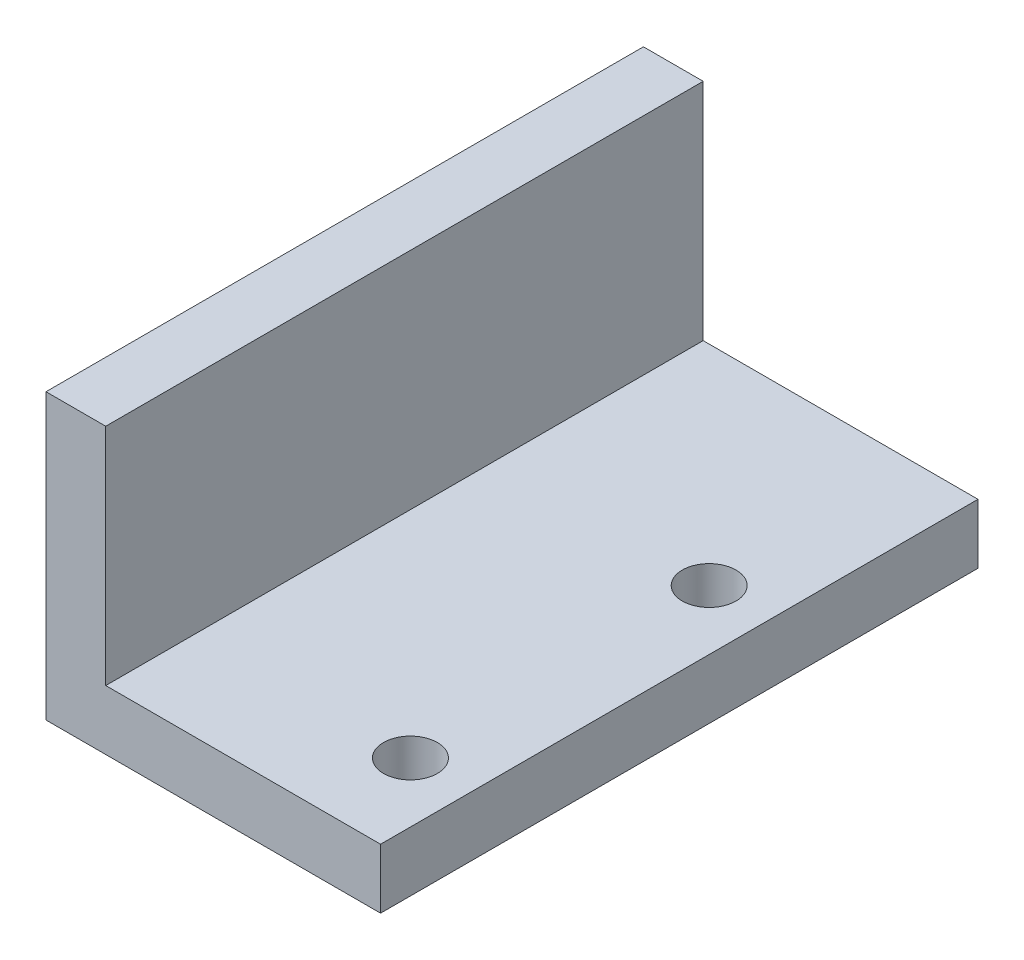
ISO-10303-21;
HEADER;
FILE_DESCRIPTION(('STEP AP214'),'2;1');
FILE_NAME('part.step','',(''),(''),'','','');
FILE_SCHEMA(('AUTOMOTIVE_DESIGN { 1 0 10303 214 1 1 1 1 }'));
ENDSEC;
DATA;
#1=APPLICATION_CONTEXT('core data for automotive mechanical design processes');
#2=APPLICATION_PROTOCOL_DEFINITION('international standard','automotive_design',2000,#1);
#3=PRODUCT_CONTEXT('',#1,'mechanical');
#4=PRODUCT('Part','Part','',(#3));
#5=PRODUCT_RELATED_PRODUCT_CATEGORY('part','',(#4));
#6=PRODUCT_DEFINITION_FORMATION('','',#4);
#7=PRODUCT_DEFINITION_CONTEXT('part definition',#1,'design');
#8=PRODUCT_DEFINITION('design','',#6,#7);
#9=PRODUCT_DEFINITION_SHAPE('','',#8);
#10=(LENGTH_UNIT() NAMED_UNIT(*) SI_UNIT(.MILLI.,.METRE.));
#11=(NAMED_UNIT(*) PLANE_ANGLE_UNIT() SI_UNIT($,.RADIAN.));
#12=(NAMED_UNIT(*) SI_UNIT($,.STERADIAN.) SOLID_ANGLE_UNIT());
#13=UNCERTAINTY_MEASURE_WITH_UNIT(LENGTH_MEASURE(1.E-05),#10,'distance_accuracy_value','');
#14=(GEOMETRIC_REPRESENTATION_CONTEXT(3) GLOBAL_UNCERTAINTY_ASSIGNED_CONTEXT((#13)) GLOBAL_UNIT_ASSIGNED_CONTEXT((#10,
#11,#12)) REPRESENTATION_CONTEXT('',''));
#15=CARTESIAN_POINT('',(0.,0.,0.));
#16=DIRECTION('',(0.,0.,1.));
#17=DIRECTION('',(1.,0.,0.));
#18=AXIS2_PLACEMENT_3D('',#15,#16,#17);
#19=CARTESIAN_POINT('',(112.,0.,-100.));
#20=DIRECTION('',(0.,1.,0.));
#21=DIRECTION('',(0.,0.,-1.));
#22=AXIS2_PLACEMENT_3D('',#19,#20,#21);
#23=PLANE('',#22);
#24=CARTESIAN_POINT('',(92.,0.,-30.));
#25=DIRECTION('',(0.,-1.,0.));
#26=DIRECTION('',(0.,0.,-1.));
#27=AXIS2_PLACEMENT_3D('',#24,#25,#26);
#28=CIRCLE('',#27,8.99999999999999);
#29=CARTESIAN_POINT('',(92.,0.,-39.));
#30=VERTEX_POINT('',#29);
#31=EDGE_CURVE('E153',#30,#30,#28,.T.);
#32=ORIENTED_EDGE('',*,*,#31,.F.);
#33=EDGE_LOOP('',(#32));
#34=FACE_BOUND('',#33,.T.);
#35=CARTESIAN_POINT('',(92.,0.,70.));
#36=DIRECTION('',(0.,-1.,0.));
#37=DIRECTION('',(0.,0.,-1.));
#38=AXIS2_PLACEMENT_3D('',#35,#36,#37);
#39=CIRCLE('',#38,8.99999999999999);
#40=CARTESIAN_POINT('',(92.,0.,61.));
#41=VERTEX_POINT('',#40);
#42=EDGE_CURVE('E123',#41,#41,#39,.T.);
#43=ORIENTED_EDGE('',*,*,#42,.F.);
#44=EDGE_LOOP('',(#43));
#45=FACE_BOUND('',#44,.T.);
#46=DIRECTION('',(1.,0.,0.));
#47=VECTOR('',#46,1.);
#48=CARTESIAN_POINT('',(112.,0.,100.));
#49=LINE('',#48,#47);
#50=CARTESIAN_POINT('',(0.,0.,100.));
#51=VERTEX_POINT('',#50);
#52=CARTESIAN_POINT('',(112.,0.,100.));
#53=VERTEX_POINT('',#52);
#54=EDGE_CURVE('E120',#51,#53,#49,.T.);
#55=ORIENTED_EDGE('',*,*,#54,.F.);
#56=DIRECTION('',(0.,0.,1.));
#57=VECTOR('',#56,1.);
#58=CARTESIAN_POINT('',(0.,0.,-100.));
#59=LINE('',#58,#57);
#60=CARTESIAN_POINT('',(0.,0.,-100.));
#61=VERTEX_POINT('',#60);
#62=EDGE_CURVE('E119',#61,#51,#59,.T.);
#63=ORIENTED_EDGE('',*,*,#62,.F.);
#64=DIRECTION('',(1.,0.,0.));
#65=VECTOR('',#64,1.);
#66=CARTESIAN_POINT('',(112.,0.,-100.));
#67=LINE('',#66,#65);
#68=CARTESIAN_POINT('',(112.,0.,-100.));
#69=VERTEX_POINT('',#68);
#70=EDGE_CURVE('E133',#61,#69,#67,.T.);
#71=ORIENTED_EDGE('',*,*,#70,.T.);
#72=DIRECTION('',(0.,0.,1.));
#73=VECTOR('',#72,1.);
#74=CARTESIAN_POINT('',(112.,0.,-100.));
#75=LINE('',#74,#73);
#76=EDGE_CURVE('E11',#69,#53,#75,.T.);
#77=ORIENTED_EDGE('',*,*,#76,.T.);
#78=EDGE_LOOP('',(#55,#63,#71,#77));
#79=FACE_BOUND('',#78,.T.);
#80=ADVANCED_FACE('F37',(#34,#45,#79),#23,.F.);
#81=CARTESIAN_POINT('',(112.,20.,-100.));
#82=DIRECTION('',(-1.,0.,0.));
#83=DIRECTION('',(0.,0.,-1.));
#84=AXIS2_PLACEMENT_3D('',#81,#82,#83);
#85=PLANE('',#84);
#86=DIRECTION('',(0.,1.,0.));
#87=VECTOR('',#86,1.);
#88=CARTESIAN_POINT('',(112.,20.,100.));
#89=LINE('',#88,#87);
#90=CARTESIAN_POINT('',(112.,20.,100.));
#91=VERTEX_POINT('',#90);
#92=EDGE_CURVE('E122',#53,#91,#89,.T.);
#93=ORIENTED_EDGE('',*,*,#92,.F.);
#94=ORIENTED_EDGE('',*,*,#76,.F.);
#95=DIRECTION('',(0.,1.,0.));
#96=VECTOR('',#95,1.);
#97=CARTESIAN_POINT('',(112.,20.,-100.));
#98=LINE('',#97,#96);
#99=CARTESIAN_POINT('',(112.,20.,-100.));
#100=VERTEX_POINT('',#99);
#101=EDGE_CURVE('E85',#69,#100,#98,.T.);
#102=ORIENTED_EDGE('',*,*,#101,.T.);
#103=DIRECTION('',(0.,0.,1.));
#104=VECTOR('',#103,1.);
#105=CARTESIAN_POINT('',(112.,20.,-100.));
#106=LINE('',#105,#104);
#107=EDGE_CURVE('E45',#100,#91,#106,.T.);
#108=ORIENTED_EDGE('',*,*,#107,.T.);
#109=EDGE_LOOP('',(#93,#94,#102,#108));
#110=FACE_BOUND('',#109,.T.);
#111=ADVANCED_FACE('F139',(#110),#85,.F.);
#112=CARTESIAN_POINT('',(20.,20.,-100.));
#113=DIRECTION('',(0.,-1.,0.));
#114=DIRECTION('',(0.,0.,1.));
#115=AXIS2_PLACEMENT_3D('',#112,#113,#114);
#116=PLANE('',#115);
#117=CARTESIAN_POINT('',(92.,20.,-30.));
#118=DIRECTION('',(0.,-1.,0.));
#119=DIRECTION('',(0.,0.,-1.));
#120=AXIS2_PLACEMENT_3D('',#117,#118,#119);
#121=CIRCLE('',#120,8.99999999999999);
#122=CARTESIAN_POINT('',(92.,20.,-39.));
#123=VERTEX_POINT('',#122);
#124=EDGE_CURVE('E156',#123,#123,#121,.T.);
#125=ORIENTED_EDGE('',*,*,#124,.T.);
#126=EDGE_LOOP('',(#125));
#127=FACE_BOUND('',#126,.T.);
#128=CARTESIAN_POINT('',(92.,20.,70.));
#129=DIRECTION('',(0.,-1.,0.));
#130=DIRECTION('',(0.,0.,-1.));
#131=AXIS2_PLACEMENT_3D('',#128,#129,#130);
#132=CIRCLE('',#131,8.99999999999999);
#133=CARTESIAN_POINT('',(92.,20.,61.));
#134=VERTEX_POINT('',#133);
#135=EDGE_CURVE('E150',#134,#134,#132,.T.);
#136=ORIENTED_EDGE('',*,*,#135,.T.);
#137=EDGE_LOOP('',(#136));
#138=FACE_BOUND('',#137,.T.);
#139=DIRECTION('',(-1.,0.,0.));
#140=VECTOR('',#139,1.);
#141=CARTESIAN_POINT('',(20.,20.,100.));
#142=LINE('',#141,#140);
#143=CARTESIAN_POINT('',(20.,20.,100.));
#144=VERTEX_POINT('',#143);
#145=EDGE_CURVE('E126',#91,#144,#142,.T.);
#146=ORIENTED_EDGE('',*,*,#145,.F.);
#147=ORIENTED_EDGE('',*,*,#107,.F.);
#148=DIRECTION('',(-1.,0.,0.));
#149=VECTOR('',#148,1.);
#150=CARTESIAN_POINT('',(20.,20.,-100.));
#151=LINE('',#150,#149);
#152=CARTESIAN_POINT('',(20.,20.,-100.));
#153=VERTEX_POINT('',#152);
#154=EDGE_CURVE('E113',#100,#153,#151,.T.);
#155=ORIENTED_EDGE('',*,*,#154,.T.);
#156=DIRECTION('',(0.,0.,1.));
#157=VECTOR('',#156,1.);
#158=CARTESIAN_POINT('',(20.,20.,-100.));
#159=LINE('',#158,#157);
#160=EDGE_CURVE('E107',#153,#144,#159,.T.);
#161=ORIENTED_EDGE('',*,*,#160,.T.);
#162=EDGE_LOOP('',(#146,#147,#155,#161));
#163=FACE_BOUND('',#162,.T.);
#164=ADVANCED_FACE('F160',(#127,#138,#163),#116,.F.);
#165=CARTESIAN_POINT('',(20.,95.1853785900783,-100.));
#166=DIRECTION('',(-1.,0.,0.));
#167=DIRECTION('',(0.,-1.,0.));
#168=AXIS2_PLACEMENT_3D('',#165,#166,#167);
#169=PLANE('',#168);
#170=DIRECTION('',(0.,1.,0.));
#171=VECTOR('',#170,1.);
#172=CARTESIAN_POINT('',(20.,95.1853785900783,100.));
#173=LINE('',#172,#171);
#174=CARTESIAN_POINT('',(20.,95.1853785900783,100.));
#175=VERTEX_POINT('',#174);
#176=EDGE_CURVE('E129',#144,#175,#173,.T.);
#177=ORIENTED_EDGE('',*,*,#176,.F.);
#178=ORIENTED_EDGE('',*,*,#160,.F.);
#179=DIRECTION('',(0.,1.,0.));
#180=VECTOR('',#179,1.);
#181=CARTESIAN_POINT('',(20.,95.1853785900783,-100.));
#182=LINE('',#181,#180);
#183=CARTESIAN_POINT('',(20.,95.1853785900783,-100.));
#184=VERTEX_POINT('',#183);
#185=EDGE_CURVE('E97',#153,#184,#182,.T.);
#186=ORIENTED_EDGE('',*,*,#185,.T.);
#187=DIRECTION('',(0.,0.,1.));
#188=VECTOR('',#187,1.);
#189=CARTESIAN_POINT('',(20.,95.1853785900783,-100.));
#190=LINE('',#189,#188);
#191=EDGE_CURVE('E102',#184,#175,#190,.T.);
#192=ORIENTED_EDGE('',*,*,#191,.T.);
#193=EDGE_LOOP('',(#177,#178,#186,#192));
#194=FACE_BOUND('',#193,.T.);
#195=ADVANCED_FACE('F110',(#194),#169,.F.);
#196=CARTESIAN_POINT('',(0.,95.1853785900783,-100.));
#197=DIRECTION('',(0.,-1.,0.));
#198=DIRECTION('',(0.,0.,1.));
#199=AXIS2_PLACEMENT_3D('',#196,#197,#198);
#200=PLANE('',#199);
#201=DIRECTION('',(-1.,0.,0.));
#202=VECTOR('',#201,1.);
#203=CARTESIAN_POINT('',(0.,95.1853785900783,100.));
#204=LINE('',#203,#202);
#205=CARTESIAN_POINT('',(0.,95.1853785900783,100.));
#206=VERTEX_POINT('',#205);
#207=EDGE_CURVE('E104',#175,#206,#204,.T.);
#208=ORIENTED_EDGE('',*,*,#207,.F.);
#209=ORIENTED_EDGE('',*,*,#191,.F.);
#210=DIRECTION('',(-1.,0.,0.));
#211=VECTOR('',#210,1.);
#212=CARTESIAN_POINT('',(0.,95.1853785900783,-100.));
#213=LINE('',#212,#211);
#214=CARTESIAN_POINT('',(0.,95.1853785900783,-100.));
#215=VERTEX_POINT('',#214);
#216=EDGE_CURVE('E93',#184,#215,#213,.T.);
#217=ORIENTED_EDGE('',*,*,#216,.T.);
#218=DIRECTION('',(0.,0.,1.));
#219=VECTOR('',#218,1.);
#220=CARTESIAN_POINT('',(0.,95.1853785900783,-100.));
#221=LINE('',#220,#219);
#222=EDGE_CURVE('E108',#215,#206,#221,.T.);
#223=ORIENTED_EDGE('',*,*,#222,.T.);
#224=EDGE_LOOP('',(#208,#209,#217,#223));
#225=FACE_BOUND('',#224,.T.);
#226=ADVANCED_FACE('F103',(#225),#200,.F.);
#227=CARTESIAN_POINT('',(0.,0.,-100.));
#228=DIRECTION('',(1.,0.,0.));
#229=DIRECTION('',(0.,0.,1.));
#230=AXIS2_PLACEMENT_3D('',#227,#228,#229);
#231=PLANE('',#230);
#232=DIRECTION('',(0.,-1.,0.));
#233=VECTOR('',#232,1.);
#234=CARTESIAN_POINT('',(0.,0.,100.));
#235=LINE('',#234,#233);
#236=EDGE_CURVE('E73',#206,#51,#235,.T.);
#237=ORIENTED_EDGE('',*,*,#236,.F.);
#238=ORIENTED_EDGE('',*,*,#222,.F.);
#239=DIRECTION('',(0.,-1.,0.));
#240=VECTOR('',#239,1.);
#241=CARTESIAN_POINT('',(0.,0.,-100.));
#242=LINE('',#241,#240);
#243=EDGE_CURVE('E53',#215,#61,#242,.T.);
#244=ORIENTED_EDGE('',*,*,#243,.T.);
#245=ORIENTED_EDGE('',*,*,#62,.T.);
#246=EDGE_LOOP('',(#237,#238,#244,#245));
#247=FACE_BOUND('',#246,.T.);
#248=ADVANCED_FACE('F184',(#247),#231,.F.);
#249=CARTESIAN_POINT('',(0.,0.,-100.));
#250=DIRECTION('',(0.,0.,1.));
#251=DIRECTION('',(-1.,0.,0.));
#252=AXIS2_PLACEMENT_3D('',#249,#250,#251);
#253=PLANE('',#252);
#254=ORIENTED_EDGE('',*,*,#70,.F.);
#255=ORIENTED_EDGE('',*,*,#243,.F.);
#256=ORIENTED_EDGE('',*,*,#216,.F.);
#257=ORIENTED_EDGE('',*,*,#185,.F.);
#258=ORIENTED_EDGE('',*,*,#154,.F.);
#259=ORIENTED_EDGE('',*,*,#101,.F.);
#260=EDGE_LOOP('',(#254,#255,#256,#257,#258,#259));
#261=FACE_BOUND('',#260,.T.);
#262=ADVANCED_FACE('F95',(#261),#253,.F.);
#263=CARTESIAN_POINT('',(0.,0.,100.));
#264=DIRECTION('',(0.,0.,1.));
#265=DIRECTION('',(-1.,0.,0.));
#266=AXIS2_PLACEMENT_3D('',#263,#264,#265);
#267=PLANE('',#266);
#268=ORIENTED_EDGE('',*,*,#54,.T.);
#269=ORIENTED_EDGE('',*,*,#92,.T.);
#270=ORIENTED_EDGE('',*,*,#145,.T.);
#271=ORIENTED_EDGE('',*,*,#176,.T.);
#272=ORIENTED_EDGE('',*,*,#207,.T.);
#273=ORIENTED_EDGE('',*,*,#236,.T.);
#274=EDGE_LOOP('',(#268,#269,#270,#271,#272,#273));
#275=FACE_BOUND('',#274,.T.);
#276=ADVANCED_FACE('F141',(#275),#267,.T.);
#277=CARTESIAN_POINT('',(92.,20.,70.));
#278=DIRECTION('',(0.,1.,0.));
#279=DIRECTION('',(0.,0.,-1.));
#280=AXIS2_PLACEMENT_3D('',#277,#278,#279);
#281=CYLINDRICAL_SURFACE('',#280,8.99999999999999);
#282=ORIENTED_EDGE('',*,*,#135,.F.);
#283=EDGE_LOOP('',(#282));
#284=FACE_BOUND('',#283,.T.);
#285=ORIENTED_EDGE('',*,*,#42,.T.);
#286=EDGE_LOOP('',(#285));
#287=FACE_BOUND('',#286,.T.);
#288=ADVANCED_FACE('F166',(#284,#287),#281,.F.);
#289=CARTESIAN_POINT('',(92.,20.,-30.));
#290=DIRECTION('',(0.,1.,0.));
#291=DIRECTION('',(0.,0.,-1.));
#292=AXIS2_PLACEMENT_3D('',#289,#290,#291);
#293=CYLINDRICAL_SURFACE('',#292,8.99999999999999);
#294=ORIENTED_EDGE('',*,*,#124,.F.);
#295=EDGE_LOOP('',(#294));
#296=FACE_BOUND('',#295,.T.);
#297=ORIENTED_EDGE('',*,*,#31,.T.);
#298=EDGE_LOOP('',(#297));
#299=FACE_BOUND('',#298,.T.);
#300=ADVANCED_FACE('F163',(#296,#299),#293,.F.);
#301=CLOSED_SHELL('',(#80,#111,#164,#195,#226,#248,#262,#276,#288,#300));
#302=MANIFOLD_SOLID_BREP('B2',#301);
#303=ADVANCED_BREP_SHAPE_REPRESENTATION('',(#18,#302),#14);
#304=SHAPE_DEFINITION_REPRESENTATION(#9,#303);
ENDSEC;
END-ISO-10303-21;
